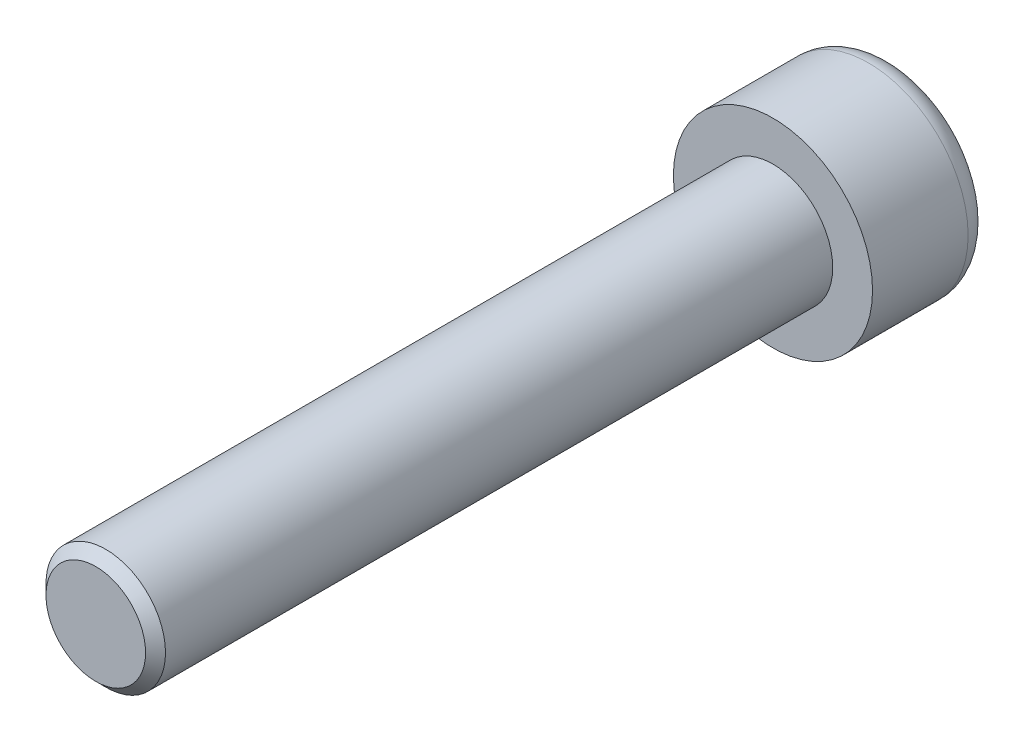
ISO-10303-21;
HEADER;
FILE_DESCRIPTION(('STEP AP214'),'2;1');
FILE_NAME('part.step','',(''),(''),'','','');
FILE_SCHEMA(('AUTOMOTIVE_DESIGN { 1 0 10303 214 1 1 1 1 }'));
ENDSEC;
DATA;
#1=APPLICATION_CONTEXT('core data for automotive mechanical design processes');
#2=APPLICATION_PROTOCOL_DEFINITION('international standard','automotive_design',2000,#1);
#3=PRODUCT_CONTEXT('',#1,'mechanical');
#4=PRODUCT('Part','Part','',(#3));
#5=PRODUCT_RELATED_PRODUCT_CATEGORY('part','',(#4));
#6=PRODUCT_DEFINITION_FORMATION('','',#4);
#7=PRODUCT_DEFINITION_CONTEXT('part definition',#1,'design');
#8=PRODUCT_DEFINITION('design','',#6,#7);
#9=PRODUCT_DEFINITION_SHAPE('','',#8);
#10=(LENGTH_UNIT() NAMED_UNIT(*) SI_UNIT(.MILLI.,.METRE.));
#11=(NAMED_UNIT(*) PLANE_ANGLE_UNIT() SI_UNIT($,.RADIAN.));
#12=(NAMED_UNIT(*) SI_UNIT($,.STERADIAN.) SOLID_ANGLE_UNIT());
#13=UNCERTAINTY_MEASURE_WITH_UNIT(LENGTH_MEASURE(1.E-05),#10,'distance_accuracy_value','');
#14=(GEOMETRIC_REPRESENTATION_CONTEXT(3) GLOBAL_UNCERTAINTY_ASSIGNED_CONTEXT((#13)) GLOBAL_UNIT_ASSIGNED_CONTEXT((#10,
#11,#12)) REPRESENTATION_CONTEXT('',''));
#15=CARTESIAN_POINT('',(0.,0.,0.));
#16=DIRECTION('',(0.,0.,1.));
#17=DIRECTION('',(1.,0.,0.));
#18=AXIS2_PLACEMENT_3D('',#15,#16,#17);
#19=CARTESIAN_POINT('',(0.,0.,41.));
#20=DIRECTION('',(0.,0.,-1.));
#21=DIRECTION('',(-1.,0.,0.));
#22=AXIS2_PLACEMENT_3D('',#19,#20,#21);
#23=CYLINDRICAL_SURFACE('',#22,3.);
#24=CARTESIAN_POINT('',(0.,0.,39.5));
#25=DIRECTION('',(0.,0.,1.));
#26=DIRECTION('',(1.,0.,0.));
#27=AXIS2_PLACEMENT_3D('',#24,#25,#26);
#28=CIRCLE('',#27,3.);
#29=CARTESIAN_POINT('',(3.,0.,39.5));
#30=VERTEX_POINT('',#29);
#31=EDGE_CURVE('E11',#30,#30,#28,.F.);
#32=ORIENTED_EDGE('',*,*,#31,.T.);
#33=EDGE_LOOP('',(#32));
#34=FACE_BOUND('',#33,.T.);
#35=CARTESIAN_POINT('',(0.,0.,6.));
#36=DIRECTION('',(0.,0.,1.));
#37=DIRECTION('',(1.,0.,0.));
#38=AXIS2_PLACEMENT_3D('',#35,#36,#37);
#39=CIRCLE('',#38,3.);
#40=CARTESIAN_POINT('',(3.,0.,6.));
#41=VERTEX_POINT('',#40);
#42=EDGE_CURVE('E118',#41,#41,#39,.T.);
#43=ORIENTED_EDGE('',*,*,#42,.T.);
#44=EDGE_LOOP('',(#43));
#45=FACE_BOUND('',#44,.T.);
#46=ADVANCED_FACE('F16',(#34,#45),#23,.T.);
#47=CARTESIAN_POINT('',(0.,0.,6.));
#48=DIRECTION('',(0.,0.,1.));
#49=DIRECTION('',(1.,0.,0.));
#50=AXIS2_PLACEMENT_3D('',#47,#48,#49);
#51=PLANE('',#50);
#52=CARTESIAN_POINT('',(0.,0.,6.));
#53=DIRECTION('',(0.,0.,1.));
#54=DIRECTION('',(1.,0.,0.));
#55=AXIS2_PLACEMENT_3D('',#52,#53,#54);
#56=CIRCLE('',#55,5.);
#57=CARTESIAN_POINT('',(5.,0.,6.));
#58=VERTEX_POINT('',#57);
#59=EDGE_CURVE('E126',#58,#58,#56,.T.);
#60=ORIENTED_EDGE('',*,*,#59,.T.);
#61=EDGE_LOOP('',(#60));
#62=FACE_BOUND('',#61,.T.);
#63=ORIENTED_EDGE('',*,*,#42,.F.);
#64=EDGE_LOOP('',(#63));
#65=FACE_BOUND('',#64,.T.);
#66=ADVANCED_FACE('F154',(#62,#65),#51,.T.);
#67=CARTESIAN_POINT('',(0.,0.,6.));
#68=DIRECTION('',(0.,0.,-1.));
#69=DIRECTION('',(-1.,0.,0.));
#70=AXIS2_PLACEMENT_3D('',#67,#68,#69);
#71=CYLINDRICAL_SURFACE('',#70,5.);
#72=CARTESIAN_POINT('',(0.,0.,1.2));
#73=DIRECTION('',(0.,0.,1.));
#74=DIRECTION('',(1.,0.,0.));
#75=AXIS2_PLACEMENT_3D('',#72,#73,#74);
#76=CIRCLE('',#75,5.);
#77=CARTESIAN_POINT('',(5.,0.,1.2));
#78=VERTEX_POINT('',#77);
#79=EDGE_CURVE('E129',#78,#78,#76,.T.);
#80=ORIENTED_EDGE('',*,*,#79,.T.);
#81=EDGE_LOOP('',(#80));
#82=FACE_BOUND('',#81,.T.);
#83=ORIENTED_EDGE('',*,*,#59,.F.);
#84=EDGE_LOOP('',(#83));
#85=FACE_BOUND('',#84,.T.);
#86=ADVANCED_FACE('F161',(#82,#85),#71,.T.);
#87=CARTESIAN_POINT('',(0.,0.,0.));
#88=DIRECTION('',(0.,0.,1.));
#89=DIRECTION('',(1.,0.,0.));
#90=AXIS2_PLACEMENT_3D('',#87,#88,#89);
#91=PLANE('',#90);
#92=DIRECTION('',(0.866025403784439,-0.5,0.));
#93=VECTOR('',#92,1.);
#94=CARTESIAN_POINT('',(0.,2.88675134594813,0.));
#95=LINE('',#94,#93);
#96=CARTESIAN_POINT('',(0.,2.88675134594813,0.));
#97=VERTEX_POINT('',#96);
#98=CARTESIAN_POINT('',(2.5,1.44337567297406,0.));
#99=VERTEX_POINT('',#98);
#100=EDGE_CURVE('E105',#97,#99,#95,.T.);
#101=ORIENTED_EDGE('',*,*,#100,.F.);
#102=DIRECTION('',(0.866025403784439,0.5,0.));
#103=VECTOR('',#102,1.);
#104=CARTESIAN_POINT('',(-2.5,1.44337567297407,0.));
#105=LINE('',#104,#103);
#106=CARTESIAN_POINT('',(-2.5,1.44337567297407,0.));
#107=VERTEX_POINT('',#106);
#108=EDGE_CURVE('E31',#107,#97,#105,.T.);
#109=ORIENTED_EDGE('',*,*,#108,.F.);
#110=DIRECTION('',(0.,1.,0.));
#111=VECTOR('',#110,1.);
#112=CARTESIAN_POINT('',(-2.5,-1.44337567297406,0.));
#113=LINE('',#112,#111);
#114=CARTESIAN_POINT('',(-2.5,-1.44337567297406,0.));
#115=VERTEX_POINT('',#114);
#116=EDGE_CURVE('E114',#115,#107,#113,.T.);
#117=ORIENTED_EDGE('',*,*,#116,.F.);
#118=DIRECTION('',(-0.866025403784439,0.5,0.));
#119=VECTOR('',#118,1.);
#120=CARTESIAN_POINT('',(0.,-2.88675134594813,0.));
#121=LINE('',#120,#119);
#122=CARTESIAN_POINT('',(0.,-2.88675134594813,0.));
#123=VERTEX_POINT('',#122);
#124=EDGE_CURVE('E112',#123,#115,#121,.T.);
#125=ORIENTED_EDGE('',*,*,#124,.F.);
#126=DIRECTION('',(-0.866025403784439,-0.5,0.));
#127=VECTOR('',#126,1.);
#128=CARTESIAN_POINT('',(2.5,-1.44337567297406,0.));
#129=LINE('',#128,#127);
#130=CARTESIAN_POINT('',(2.5,-1.44337567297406,0.));
#131=VERTEX_POINT('',#130);
#132=EDGE_CURVE('E79',#131,#123,#129,.T.);
#133=ORIENTED_EDGE('',*,*,#132,.F.);
#134=DIRECTION('',(0.,-1.,0.));
#135=VECTOR('',#134,1.);
#136=CARTESIAN_POINT('',(2.5,1.44337567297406,0.));
#137=LINE('',#136,#135);
#138=EDGE_CURVE('E108',#99,#131,#137,.T.);
#139=ORIENTED_EDGE('',*,*,#138,.F.);
#140=EDGE_LOOP('',(#101,#109,#117,#125,#133,#139));
#141=FACE_BOUND('',#140,.T.);
#142=CARTESIAN_POINT('',(0.,0.,0.));
#143=DIRECTION('',(0.,0.,1.));
#144=DIRECTION('',(1.,0.,0.));
#145=AXIS2_PLACEMENT_3D('',#142,#143,#144);
#146=CIRCLE('',#145,3.8);
#147=CARTESIAN_POINT('',(3.8,0.,0.));
#148=VERTEX_POINT('',#147);
#149=EDGE_CURVE('E132',#148,#148,#146,.F.);
#150=ORIENTED_EDGE('',*,*,#149,.T.);
#151=EDGE_LOOP('',(#150));
#152=FACE_BOUND('',#151,.T.);
#153=ADVANCED_FACE('F166',(#141,#152),#91,.F.);
#154=CARTESIAN_POINT('',(0.,0.,1.2));
#155=DIRECTION('',(0.,0.,1.));
#156=DIRECTION('',(1.,0.,0.));
#157=AXIS2_PLACEMENT_3D('',#154,#155,#156);
#158=TOROIDAL_SURFACE('',#157,3.8,1.2);
#159=ORIENTED_EDGE('',*,*,#149,.F.);
#160=EDGE_LOOP('',(#159));
#161=FACE_BOUND('',#160,.T.);
#162=ORIENTED_EDGE('',*,*,#79,.F.);
#163=EDGE_LOOP('',(#162));
#164=FACE_BOUND('',#163,.T.);
#165=ADVANCED_FACE('F150',(#161,#164),#158,.T.);
#166=CARTESIAN_POINT('',(0.,0.,40.));
#167=DIRECTION('',(0.,0.,1.));
#168=DIRECTION('',(1.,0.,0.));
#169=AXIS2_PLACEMENT_3D('',#166,#167,#168);
#170=PLANE('',#169);
#171=CARTESIAN_POINT('',(0.,0.,40.));
#172=DIRECTION('',(0.,0.,1.));
#173=DIRECTION('',(1.,0.,0.));
#174=AXIS2_PLACEMENT_3D('',#171,#172,#173);
#175=CIRCLE('',#174,2.5);
#176=CARTESIAN_POINT('',(2.5,0.,40.));
#177=VERTEX_POINT('',#176);
#178=EDGE_CURVE('E24',#177,#177,#175,.T.);
#179=ORIENTED_EDGE('',*,*,#178,.T.);
#180=EDGE_LOOP('',(#179));
#181=FACE_BOUND('',#180,.T.);
#182=ADVANCED_FACE('F137',(#181),#170,.T.);
#183=CARTESIAN_POINT('',(0.,0.,40.));
#184=DIRECTION('',(0.,0.,-1.));
#185=DIRECTION('',(-1.,0.,0.));
#186=AXIS2_PLACEMENT_3D('',#183,#184,#185);
#187=CONICAL_SURFACE('',#186,2.5,0.785398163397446);
#188=ORIENTED_EDGE('',*,*,#31,.F.);
#189=EDGE_LOOP('',(#188));
#190=FACE_BOUND('',#189,.T.);
#191=ORIENTED_EDGE('',*,*,#178,.F.);
#192=EDGE_LOOP('',(#191));
#193=FACE_BOUND('',#192,.T.);
#194=ADVANCED_FACE('F18',(#190,#193),#187,.T.);
#195=CARTESIAN_POINT('',(-2.5,1.44337567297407,3.));
#196=DIRECTION('',(-0.5,0.866025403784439,0.));
#197=DIRECTION('',(-0.866025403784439,-0.5,0.));
#198=AXIS2_PLACEMENT_3D('',#195,#196,#197);
#199=PLANE('',#198);
#200=ORIENTED_EDGE('',*,*,#108,.T.);
#201=DIRECTION('',(0.,0.,-1.));
#202=VECTOR('',#201,1.);
#203=CARTESIAN_POINT('',(0.,2.88675134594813,3.));
#204=LINE('',#203,#202);
#205=CARTESIAN_POINT('',(0.,2.88675134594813,3.));
#206=VERTEX_POINT('',#205);
#207=EDGE_CURVE('E61',#206,#97,#204,.T.);
#208=ORIENTED_EDGE('',*,*,#207,.F.);
#209=DIRECTION('',(0.866025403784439,0.5,0.));
#210=VECTOR('',#209,1.);
#211=CARTESIAN_POINT('',(-2.5,1.44337567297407,3.));
#212=LINE('',#211,#210);
#213=CARTESIAN_POINT('',(-2.5,1.44337567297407,3.));
#214=VERTEX_POINT('',#213);
#215=EDGE_CURVE('E116',#214,#206,#212,.T.);
#216=ORIENTED_EDGE('',*,*,#215,.F.);
#217=DIRECTION('',(0.,0.,-1.));
#218=VECTOR('',#217,1.);
#219=CARTESIAN_POINT('',(-2.5,1.44337567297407,3.));
#220=LINE('',#219,#218);
#221=EDGE_CURVE('E39',#214,#107,#220,.T.);
#222=ORIENTED_EDGE('',*,*,#221,.T.);
#223=EDGE_LOOP('',(#200,#208,#216,#222));
#224=FACE_BOUND('',#223,.T.);
#225=ADVANCED_FACE('F140',(#224),#199,.F.);
#226=CARTESIAN_POINT('',(-2.5,-1.44337567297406,3.));
#227=DIRECTION('',(-1.,0.,0.));
#228=DIRECTION('',(0.,-1.,0.));
#229=AXIS2_PLACEMENT_3D('',#226,#227,#228);
#230=PLANE('',#229);
#231=ORIENTED_EDGE('',*,*,#116,.T.);
#232=ORIENTED_EDGE('',*,*,#221,.F.);
#233=DIRECTION('',(0.,1.,0.));
#234=VECTOR('',#233,1.);
#235=CARTESIAN_POINT('',(-2.5,-1.44337567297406,3.));
#236=LINE('',#235,#234);
#237=CARTESIAN_POINT('',(-2.5,-1.44337567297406,3.));
#238=VERTEX_POINT('',#237);
#239=EDGE_CURVE('E91',#238,#214,#236,.T.);
#240=ORIENTED_EDGE('',*,*,#239,.F.);
#241=DIRECTION('',(0.,0.,-1.));
#242=VECTOR('',#241,1.);
#243=CARTESIAN_POINT('',(-2.5,-1.44337567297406,3.));
#244=LINE('',#243,#242);
#245=EDGE_CURVE('E83',#238,#115,#244,.T.);
#246=ORIENTED_EDGE('',*,*,#245,.T.);
#247=EDGE_LOOP('',(#231,#232,#240,#246));
#248=FACE_BOUND('',#247,.T.);
#249=ADVANCED_FACE('F148',(#248),#230,.F.);
#250=CARTESIAN_POINT('',(0.,-2.88675134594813,3.));
#251=DIRECTION('',(-0.5,-0.866025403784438,0.));
#252=DIRECTION('',(0.866025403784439,-0.5,0.));
#253=AXIS2_PLACEMENT_3D('',#250,#251,#252);
#254=PLANE('',#253);
#255=ORIENTED_EDGE('',*,*,#124,.T.);
#256=ORIENTED_EDGE('',*,*,#245,.F.);
#257=DIRECTION('',(-0.866025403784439,0.5,0.));
#258=VECTOR('',#257,1.);
#259=CARTESIAN_POINT('',(0.,-2.88675134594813,3.));
#260=LINE('',#259,#258);
#261=CARTESIAN_POINT('',(0.,-2.88675134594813,3.));
#262=VERTEX_POINT('',#261);
#263=EDGE_CURVE('E87',#262,#238,#260,.T.);
#264=ORIENTED_EDGE('',*,*,#263,.F.);
#265=DIRECTION('',(0.,0.,-1.));
#266=VECTOR('',#265,1.);
#267=CARTESIAN_POINT('',(0.,-2.88675134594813,3.));
#268=LINE('',#267,#266);
#269=EDGE_CURVE('E72',#262,#123,#268,.T.);
#270=ORIENTED_EDGE('',*,*,#269,.T.);
#271=EDGE_LOOP('',(#255,#256,#264,#270));
#272=FACE_BOUND('',#271,.T.);
#273=ADVANCED_FACE('F88',(#272),#254,.F.);
#274=CARTESIAN_POINT('',(2.5,-1.44337567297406,3.));
#275=DIRECTION('',(0.5,-0.866025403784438,0.));
#276=DIRECTION('',(0.866025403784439,0.5,0.));
#277=AXIS2_PLACEMENT_3D('',#274,#275,#276);
#278=PLANE('',#277);
#279=ORIENTED_EDGE('',*,*,#132,.T.);
#280=ORIENTED_EDGE('',*,*,#269,.F.);
#281=DIRECTION('',(-0.866025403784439,-0.5,0.));
#282=VECTOR('',#281,1.);
#283=CARTESIAN_POINT('',(2.5,-1.44337567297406,3.));
#284=LINE('',#283,#282);
#285=CARTESIAN_POINT('',(2.5,-1.44337567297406,3.));
#286=VERTEX_POINT('',#285);
#287=EDGE_CURVE('E76',#286,#262,#284,.T.);
#288=ORIENTED_EDGE('',*,*,#287,.F.);
#289=DIRECTION('',(0.,0.,-1.));
#290=VECTOR('',#289,1.);
#291=CARTESIAN_POINT('',(2.5,-1.44337567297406,3.));
#292=LINE('',#291,#290);
#293=EDGE_CURVE('E84',#286,#131,#292,.T.);
#294=ORIENTED_EDGE('',*,*,#293,.T.);
#295=EDGE_LOOP('',(#279,#280,#288,#294));
#296=FACE_BOUND('',#295,.T.);
#297=ADVANCED_FACE('F74',(#296),#278,.F.);
#298=CARTESIAN_POINT('',(2.5,1.44337567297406,3.));
#299=DIRECTION('',(1.,0.,0.));
#300=DIRECTION('',(0.,0.,-1.));
#301=AXIS2_PLACEMENT_3D('',#298,#299,#300);
#302=PLANE('',#301);
#303=ORIENTED_EDGE('',*,*,#138,.T.);
#304=ORIENTED_EDGE('',*,*,#293,.F.);
#305=DIRECTION('',(0.,-1.,0.));
#306=VECTOR('',#305,1.);
#307=CARTESIAN_POINT('',(2.5,1.44337567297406,3.));
#308=LINE('',#307,#306);
#309=CARTESIAN_POINT('',(2.5,1.44337567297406,3.));
#310=VERTEX_POINT('',#309);
#311=EDGE_CURVE('E97',#310,#286,#308,.T.);
#312=ORIENTED_EDGE('',*,*,#311,.F.);
#313=DIRECTION('',(0.,0.,-1.));
#314=VECTOR('',#313,1.);
#315=CARTESIAN_POINT('',(2.5,1.44337567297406,3.));
#316=LINE('',#315,#314);
#317=EDGE_CURVE('E121',#310,#99,#316,.T.);
#318=ORIENTED_EDGE('',*,*,#317,.T.);
#319=EDGE_LOOP('',(#303,#304,#312,#318));
#320=FACE_BOUND('',#319,.T.);
#321=ADVANCED_FACE('F230',(#320),#302,.F.);
#322=CARTESIAN_POINT('',(0.,2.88675134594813,3.));
#323=DIRECTION('',(0.5,0.866025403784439,0.));
#324=DIRECTION('',(-0.866025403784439,0.5,0.));
#325=AXIS2_PLACEMENT_3D('',#322,#323,#324);
#326=PLANE('',#325);
#327=ORIENTED_EDGE('',*,*,#100,.T.);
#328=ORIENTED_EDGE('',*,*,#317,.F.);
#329=DIRECTION('',(0.866025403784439,-0.5,0.));
#330=VECTOR('',#329,1.);
#331=CARTESIAN_POINT('',(0.,2.88675134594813,3.));
#332=LINE('',#331,#330);
#333=EDGE_CURVE('E99',#206,#310,#332,.T.);
#334=ORIENTED_EDGE('',*,*,#333,.F.);
#335=ORIENTED_EDGE('',*,*,#207,.T.);
#336=EDGE_LOOP('',(#327,#328,#334,#335));
#337=FACE_BOUND('',#336,.T.);
#338=ADVANCED_FACE('F237',(#337),#326,.F.);
#339=CARTESIAN_POINT('',(0.,2.88675134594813,3.));
#340=DIRECTION('',(0.,0.,-1.));
#341=DIRECTION('',(-1.,0.,0.));
#342=AXIS2_PLACEMENT_3D('',#339,#340,#341);
#343=PLANE('',#342);
#344=ORIENTED_EDGE('',*,*,#215,.T.);
#345=ORIENTED_EDGE('',*,*,#333,.T.);
#346=ORIENTED_EDGE('',*,*,#311,.T.);
#347=ORIENTED_EDGE('',*,*,#287,.T.);
#348=ORIENTED_EDGE('',*,*,#263,.T.);
#349=ORIENTED_EDGE('',*,*,#239,.T.);
#350=EDGE_LOOP('',(#344,#345,#346,#347,#348,#349));
#351=FACE_BOUND('',#350,.T.);
#352=ADVANCED_FACE('F94',(#351),#343,.T.);
#353=CLOSED_SHELL('',(#46,#66,#86,#153,#165,#182,#194,#225,#249,#273,#297,#321,#338,#352));
#354=MANIFOLD_SOLID_BREP('B1',#353);
#355=ADVANCED_BREP_SHAPE_REPRESENTATION('',(#18,#354),#14);
#356=SHAPE_DEFINITION_REPRESENTATION(#9,#355);
ENDSEC;
END-ISO-10303-21;
